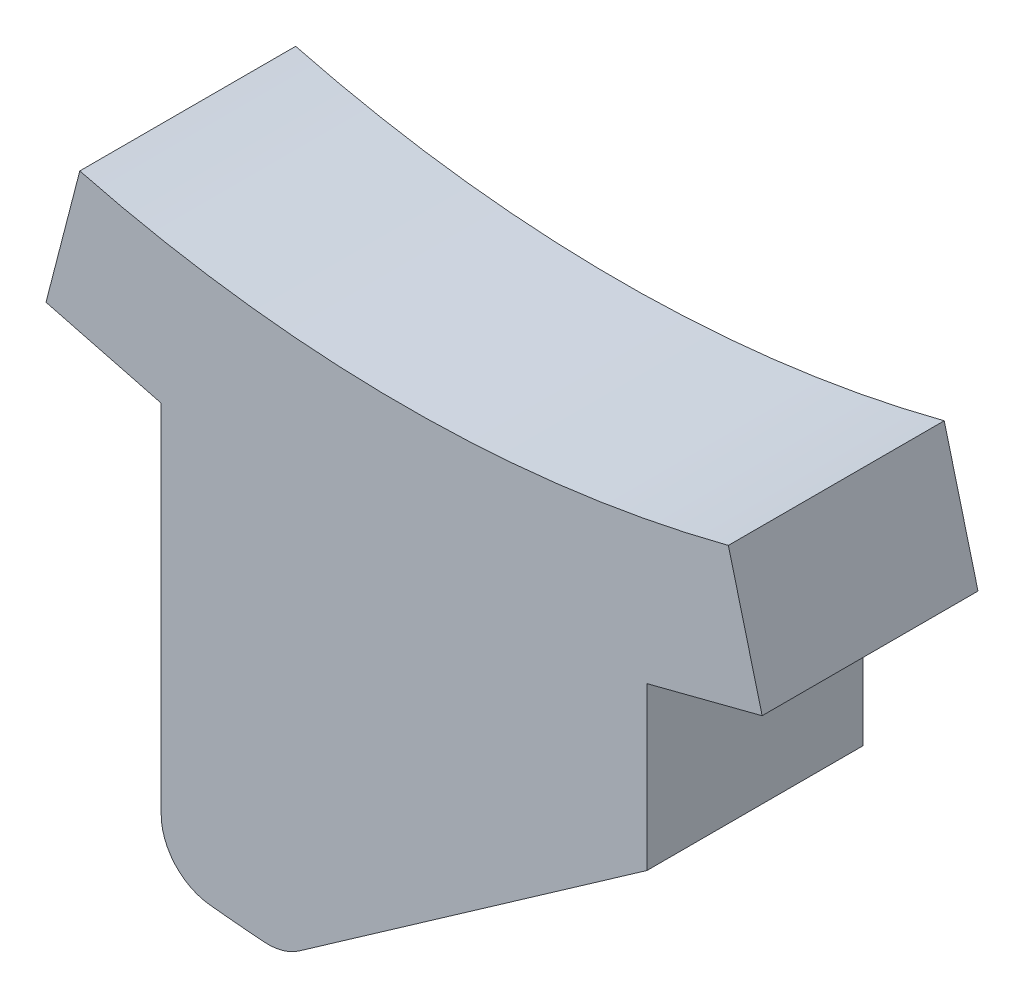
ISO-10303-21;
HEADER;
FILE_DESCRIPTION(('STEP AP214'),'2;1');
FILE_NAME('part.step','',(''),(''),'','','');
FILE_SCHEMA(('AUTOMOTIVE_DESIGN { 1 0 10303 214 1 1 1 1 }'));
ENDSEC;
DATA;
#1=APPLICATION_CONTEXT('core data for automotive mechanical design processes');
#2=APPLICATION_PROTOCOL_DEFINITION('international standard','automotive_design',2000,#1);
#3=PRODUCT_CONTEXT('',#1,'mechanical');
#4=PRODUCT('Part','Part','',(#3));
#5=PRODUCT_RELATED_PRODUCT_CATEGORY('part','',(#4));
#6=PRODUCT_DEFINITION_FORMATION('','',#4);
#7=PRODUCT_DEFINITION_CONTEXT('part definition',#1,'design');
#8=PRODUCT_DEFINITION('design','',#6,#7);
#9=PRODUCT_DEFINITION_SHAPE('','',#8);
#10=(LENGTH_UNIT() NAMED_UNIT(*) SI_UNIT(.MILLI.,.METRE.));
#11=(NAMED_UNIT(*) PLANE_ANGLE_UNIT() SI_UNIT($,.RADIAN.));
#12=(NAMED_UNIT(*) SI_UNIT($,.STERADIAN.) SOLID_ANGLE_UNIT());
#13=UNCERTAINTY_MEASURE_WITH_UNIT(LENGTH_MEASURE(1.E-05),#10,'distance_accuracy_value','');
#14=(GEOMETRIC_REPRESENTATION_CONTEXT(3) GLOBAL_UNCERTAINTY_ASSIGNED_CONTEXT((#13)) GLOBAL_UNIT_ASSIGNED_CONTEXT((#10,
#11,#12)) REPRESENTATION_CONTEXT('',''));
#15=CARTESIAN_POINT('',(0.,0.,0.));
#16=DIRECTION('',(0.,0.,1.));
#17=DIRECTION('',(1.,0.,0.));
#18=AXIS2_PLACEMENT_3D('',#15,#16,#17);
#19=CARTESIAN_POINT('',(0.,152.4,12.7));
#20=DIRECTION('',(0.,0.,-1.));
#21=DIRECTION('',(-1.,0.,0.));
#22=AXIS2_PLACEMENT_3D('',#19,#20,#21);
#23=CYLINDRICAL_SURFACE('',#22,152.4);
#24=CARTESIAN_POINT('',(0.,152.4,-12.7));
#25=DIRECTION('',(0.,0.,-1.));
#26=DIRECTION('',(1.,0.,0.));
#27=AXIS2_PLACEMENT_3D('',#24,#25,#26);
#28=CIRCLE('',#27,152.4);
#29=CARTESIAN_POINT('',(38.157912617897,4.85429960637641,-12.7));
#30=VERTEX_POINT('',#29);
#31=CARTESIAN_POINT('',(-38.157912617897,4.8542996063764,-12.7));
#32=VERTEX_POINT('',#31);
#33=EDGE_CURVE('E119',#30,#32,#28,.T.);
#34=ORIENTED_EDGE('',*,*,#33,.T.);
#35=DIRECTION('',(0.,0.,-1.));
#36=VECTOR('',#35,1.);
#37=CARTESIAN_POINT('',(-38.157912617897,4.8542996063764,12.7));
#38=LINE('',#37,#36);
#39=CARTESIAN_POINT('',(-38.157912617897,4.8542996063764,12.7));
#40=VERTEX_POINT('',#39);
#41=EDGE_CURVE('E127',#40,#32,#38,.T.);
#42=ORIENTED_EDGE('',*,*,#41,.F.);
#43=CARTESIAN_POINT('',(0.,152.4,12.7));
#44=DIRECTION('',(0.,0.,-1.));
#45=DIRECTION('',(1.,0.,0.));
#46=AXIS2_PLACEMENT_3D('',#43,#44,#45);
#47=CIRCLE('',#46,152.4);
#48=CARTESIAN_POINT('',(38.157912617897,4.85429960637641,12.7));
#49=VERTEX_POINT('',#48);
#50=EDGE_CURVE('E155',#49,#40,#47,.T.);
#51=ORIENTED_EDGE('',*,*,#50,.F.);
#52=DIRECTION('',(0.,0.,-1.));
#53=VECTOR('',#52,1.);
#54=CARTESIAN_POINT('',(38.157912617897,4.85429960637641,12.7));
#55=LINE('',#54,#53);
#56=EDGE_CURVE('E138',#49,#30,#55,.T.);
#57=ORIENTED_EDGE('',*,*,#56,.T.);
#58=EDGE_LOOP('',(#34,#42,#51,#57));
#59=FACE_BOUND('',#58,.T.);
#60=ADVANCED_FACE('F28',(#59),#23,.F.);
#61=CARTESIAN_POINT('',(-38.157912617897,4.8542996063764,12.7));
#62=DIRECTION('',(0.968147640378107,-0.250380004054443,0.));
#63=DIRECTION('',(0.250380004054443,0.968147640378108,0.));
#64=AXIS2_PLACEMENT_3D('',#61,#62,#63);
#65=PLANE('',#64);
#66=DIRECTION('',(-0.250380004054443,-0.968147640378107,0.));
#67=VECTOR('',#66,1.);
#68=CARTESIAN_POINT('',(-38.157912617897,4.8542996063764,-12.7));
#69=LINE('',#68,#67);
#70=CARTESIAN_POINT('',(-42.1326951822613,-10.5150441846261,-12.7));
#71=VERTEX_POINT('',#70);
#72=EDGE_CURVE('E113',#32,#71,#69,.T.);
#73=ORIENTED_EDGE('',*,*,#72,.T.);
#74=DIRECTION('',(0.,0.,-1.));
#75=VECTOR('',#74,1.);
#76=CARTESIAN_POINT('',(-42.1326951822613,-10.5150441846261,12.7));
#77=LINE('',#76,#75);
#78=CARTESIAN_POINT('',(-42.1326951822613,-10.5150441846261,12.7));
#79=VERTEX_POINT('',#78);
#80=EDGE_CURVE('E134',#79,#71,#77,.T.);
#81=ORIENTED_EDGE('',*,*,#80,.F.);
#82=DIRECTION('',(-0.250380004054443,-0.968147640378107,0.));
#83=VECTOR('',#82,1.);
#84=CARTESIAN_POINT('',(-38.157912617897,4.8542996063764,12.7));
#85=LINE('',#84,#83);
#86=EDGE_CURVE('E129',#40,#79,#85,.T.);
#87=ORIENTED_EDGE('',*,*,#86,.F.);
#88=ORIENTED_EDGE('',*,*,#41,.T.);
#89=EDGE_LOOP('',(#73,#81,#87,#88));
#90=FACE_BOUND('',#89,.T.);
#91=ADVANCED_FACE('F128',(#90),#65,.F.);
#92=CARTESIAN_POINT('',(-42.1326951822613,-10.5150441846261,12.7));
#93=DIRECTION('',(0.250380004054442,0.968147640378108,0.));
#94=DIRECTION('',(-0.968147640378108,0.250380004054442,0.));
#95=AXIS2_PLACEMENT_3D('',#92,#93,#94);
#96=PLANE('',#95);
#97=DIRECTION('',(0.968147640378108,-0.250380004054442,0.));
#98=VECTOR('',#97,1.);
#99=CARTESIAN_POINT('',(-42.1326951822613,-10.5150441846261,-12.7));
#100=LINE('',#99,#98);
#101=CARTESIAN_POINT('',(-28.575,-14.021302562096,-12.7));
#102=VERTEX_POINT('',#101);
#103=EDGE_CURVE('E121',#71,#102,#100,.T.);
#104=ORIENTED_EDGE('',*,*,#103,.T.);
#105=DIRECTION('',(0.,0.,-1.));
#106=VECTOR('',#105,1.);
#107=CARTESIAN_POINT('',(-28.575,-14.021302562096,12.7));
#108=LINE('',#107,#106);
#109=CARTESIAN_POINT('',(-28.575,-14.021302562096,12.7));
#110=VERTEX_POINT('',#109);
#111=EDGE_CURVE('E182',#110,#102,#108,.T.);
#112=ORIENTED_EDGE('',*,*,#111,.F.);
#113=DIRECTION('',(0.968147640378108,-0.250380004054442,0.));
#114=VECTOR('',#113,1.);
#115=CARTESIAN_POINT('',(-42.1326951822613,-10.5150441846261,12.7));
#116=LINE('',#115,#114);
#117=EDGE_CURVE('E158',#79,#110,#116,.T.);
#118=ORIENTED_EDGE('',*,*,#117,.F.);
#119=ORIENTED_EDGE('',*,*,#80,.T.);
#120=EDGE_LOOP('',(#104,#112,#118,#119));
#121=FACE_BOUND('',#120,.T.);
#122=ADVANCED_FACE('F208',(#121),#96,.F.);
#123=CARTESIAN_POINT('',(-28.575,-14.021302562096,12.7));
#124=DIRECTION('',(1.,0.,0.));
#125=DIRECTION('',(0.,1.,0.));
#126=AXIS2_PLACEMENT_3D('',#123,#124,#125);
#127=PLANE('',#126);
#128=DIRECTION('',(0.,-1.,0.));
#129=VECTOR('',#128,1.);
#130=CARTESIAN_POINT('',(-28.575,-14.021302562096,-12.7));
#131=LINE('',#130,#129);
#132=CARTESIAN_POINT('',(-28.575,-55.9680682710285,-12.7));
#133=VERTEX_POINT('',#132);
#134=EDGE_CURVE('E142',#102,#133,#131,.T.);
#135=ORIENTED_EDGE('',*,*,#134,.T.);
#136=DIRECTION('',(0.,0.,-1.));
#137=VECTOR('',#136,1.);
#138=CARTESIAN_POINT('',(-28.575,-55.9680682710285,12.7));
#139=LINE('',#138,#137);
#140=CARTESIAN_POINT('',(-28.575,-55.9680682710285,12.7));
#141=VERTEX_POINT('',#140);
#142=EDGE_CURVE('E50',#133,#141,#139,.F.);
#143=ORIENTED_EDGE('',*,*,#142,.T.);
#144=DIRECTION('',(0.,-1.,0.));
#145=VECTOR('',#144,1.);
#146=CARTESIAN_POINT('',(-28.575,-14.021302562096,12.7));
#147=LINE('',#146,#145);
#148=EDGE_CURVE('E160',#110,#141,#147,.T.);
#149=ORIENTED_EDGE('',*,*,#148,.F.);
#150=ORIENTED_EDGE('',*,*,#111,.T.);
#151=EDGE_LOOP('',(#135,#143,#149,#150));
#152=FACE_BOUND('',#151,.T.);
#153=ADVANCED_FACE('F204',(#152),#127,.F.);
#154=CARTESIAN_POINT('',(0.,152.4,12.7));
#155=DIRECTION('',(0.,0.,-1.));
#156=DIRECTION('',(-1.,0.,0.));
#157=AXIS2_PLACEMENT_3D('',#154,#155,#156);
#158=CYLINDRICAL_SURFACE('',#157,215.9);
#159=CARTESIAN_POINT('',(0.,152.4,12.7));
#160=DIRECTION('',(0.,0.,1.));
#161=DIRECTION('',(1.,0.,0.));
#162=AXIS2_PLACEMENT_3D('',#159,#160,#161);
#163=CIRCLE('',#162,215.9);
#164=CARTESIAN_POINT('',(-22.8984848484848,-62.2822521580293,12.7));
#165=VERTEX_POINT('',#164);
#166=CARTESIAN_POINT('',(-16.4943177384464,-62.8690118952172,12.7));
#167=VERTEX_POINT('',#166);
#168=EDGE_CURVE('E162',#165,#167,#163,.T.);
#169=ORIENTED_EDGE('',*,*,#168,.F.);
#170=DIRECTION('',(0.,0.,-1.));
#171=VECTOR('',#170,1.);
#172=CARTESIAN_POINT('',(-22.8984848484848,-62.2822521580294,12.7));
#173=LINE('',#172,#171);
#174=CARTESIAN_POINT('',(-22.8984848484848,-62.2822521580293,-12.7));
#175=VERTEX_POINT('',#174);
#176=EDGE_CURVE('E187',#165,#175,#173,.T.);
#177=ORIENTED_EDGE('',*,*,#176,.T.);
#178=CARTESIAN_POINT('',(0.,152.4,-12.7));
#179=DIRECTION('',(0.,0.,1.));
#180=DIRECTION('',(1.,0.,0.));
#181=AXIS2_PLACEMENT_3D('',#178,#179,#180);
#182=CIRCLE('',#181,215.9);
#183=CARTESIAN_POINT('',(-16.4943177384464,-62.8690118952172,-12.7));
#184=VERTEX_POINT('',#183);
#185=EDGE_CURVE('E144',#175,#184,#182,.T.);
#186=ORIENTED_EDGE('',*,*,#185,.T.);
#187=DIRECTION('',(0.,0.,-1.));
#188=VECTOR('',#187,1.);
#189=CARTESIAN_POINT('',(-16.4943177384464,-62.8690118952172,12.7));
#190=LINE('',#189,#188);
#191=EDGE_CURVE('E133',#184,#167,#190,.F.);
#192=ORIENTED_EDGE('',*,*,#191,.T.);
#193=EDGE_LOOP('',(#169,#177,#186,#192));
#194=FACE_BOUND('',#193,.T.);
#195=ADVANCED_FACE('F201',(#194),#158,.T.);
#196=CARTESIAN_POINT('',(-14.2128413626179,-63.0316716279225,12.7));
#197=DIRECTION('',(-0.57357643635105,0.819152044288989,0.));
#198=DIRECTION('',(-0.819152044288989,-0.57357643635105,0.));
#199=AXIS2_PLACEMENT_3D('',#196,#197,#198);
#200=PLANE('',#199);
#201=DIRECTION('',(0.819152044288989,0.57357643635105,0.));
#202=VECTOR('',#201,1.);
#203=CARTESIAN_POINT('',(-14.2128413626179,-63.0316716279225,12.7));
#204=LINE('',#203,#202);
#205=CARTESIAN_POINT('',(-12.36698037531,-61.7391858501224,12.7));
#206=VERTEX_POINT('',#205);
#207=CARTESIAN_POINT('',(28.575,-33.071302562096,12.7));
#208=VERTEX_POINT('',#207);
#209=EDGE_CURVE('E164',#206,#208,#204,.T.);
#210=ORIENTED_EDGE('',*,*,#209,.F.);
#211=DIRECTION('',(0.,0.,-1.));
#212=VECTOR('',#211,1.);
#213=CARTESIAN_POINT('',(-12.36698037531,-61.7391858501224,12.7));
#214=LINE('',#213,#212);
#215=CARTESIAN_POINT('',(-12.36698037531,-61.7391858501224,-12.7));
#216=VERTEX_POINT('',#215);
#217=EDGE_CURVE('E11',#206,#216,#214,.T.);
#218=ORIENTED_EDGE('',*,*,#217,.T.);
#219=DIRECTION('',(0.819152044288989,0.57357643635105,0.));
#220=VECTOR('',#219,1.);
#221=CARTESIAN_POINT('',(-14.2128413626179,-63.0316716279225,-12.7));
#222=LINE('',#221,#220);
#223=CARTESIAN_POINT('',(28.575,-33.071302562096,-12.7));
#224=VERTEX_POINT('',#223);
#225=EDGE_CURVE('E147',#216,#224,#222,.T.);
#226=ORIENTED_EDGE('',*,*,#225,.T.);
#227=DIRECTION('',(0.,0.,-1.));
#228=VECTOR('',#227,1.);
#229=CARTESIAN_POINT('',(28.575,-33.071302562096,12.7));
#230=LINE('',#229,#228);
#231=EDGE_CURVE('E179',#208,#224,#230,.T.);
#232=ORIENTED_EDGE('',*,*,#231,.F.);
#233=EDGE_LOOP('',(#210,#218,#226,#232));
#234=FACE_BOUND('',#233,.T.);
#235=ADVANCED_FACE('F225',(#234),#200,.F.);
#236=CARTESIAN_POINT('',(28.575,-33.071302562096,12.7));
#237=DIRECTION('',(-1.,0.,0.));
#238=DIRECTION('',(0.,-1.,0.));
#239=AXIS2_PLACEMENT_3D('',#236,#237,#238);
#240=PLANE('',#239);
#241=DIRECTION('',(0.,1.,0.));
#242=VECTOR('',#241,1.);
#243=CARTESIAN_POINT('',(28.575,-33.071302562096,-12.7));
#244=LINE('',#243,#242);
#245=CARTESIAN_POINT('',(28.575,-14.021302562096,-12.7));
#246=VERTEX_POINT('',#245);
#247=EDGE_CURVE('E149',#224,#246,#244,.T.);
#248=ORIENTED_EDGE('',*,*,#247,.T.);
#249=DIRECTION('',(0.,0.,-1.));
#250=VECTOR('',#249,1.);
#251=CARTESIAN_POINT('',(28.575,-14.021302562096,12.7));
#252=LINE('',#251,#250);
#253=CARTESIAN_POINT('',(28.575,-14.021302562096,12.7));
#254=VERTEX_POINT('',#253);
#255=EDGE_CURVE('E176',#254,#246,#252,.T.);
#256=ORIENTED_EDGE('',*,*,#255,.F.);
#257=DIRECTION('',(0.,1.,0.));
#258=VECTOR('',#257,1.);
#259=CARTESIAN_POINT('',(28.575,-33.071302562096,12.7));
#260=LINE('',#259,#258);
#261=EDGE_CURVE('E166',#208,#254,#260,.T.);
#262=ORIENTED_EDGE('',*,*,#261,.F.);
#263=ORIENTED_EDGE('',*,*,#231,.T.);
#264=EDGE_LOOP('',(#248,#256,#262,#263));
#265=FACE_BOUND('',#264,.T.);
#266=ADVANCED_FACE('F222',(#265),#240,.F.);
#267=CARTESIAN_POINT('',(28.575,-14.021302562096,12.7));
#268=DIRECTION('',(-0.250380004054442,0.968147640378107,0.));
#269=DIRECTION('',(-0.968147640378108,-0.250380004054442,0.));
#270=AXIS2_PLACEMENT_3D('',#267,#268,#269);
#271=PLANE('',#270);
#272=DIRECTION('',(0.968147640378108,0.250380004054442,0.));
#273=VECTOR('',#272,1.);
#274=CARTESIAN_POINT('',(28.575,-14.021302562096,-12.7));
#275=LINE('',#274,#273);
#276=CARTESIAN_POINT('',(42.1326951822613,-10.515044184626,-12.7));
#277=VERTEX_POINT('',#276);
#278=EDGE_CURVE('E151',#246,#277,#275,.T.);
#279=ORIENTED_EDGE('',*,*,#278,.T.);
#280=DIRECTION('',(0.,0.,-1.));
#281=VECTOR('',#280,1.);
#282=CARTESIAN_POINT('',(42.1326951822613,-10.515044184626,12.7));
#283=LINE('',#282,#281);
#284=CARTESIAN_POINT('',(42.1326951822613,-10.515044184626,12.7));
#285=VERTEX_POINT('',#284);
#286=EDGE_CURVE('E173',#285,#277,#283,.T.);
#287=ORIENTED_EDGE('',*,*,#286,.F.);
#288=DIRECTION('',(0.968147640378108,0.250380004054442,0.));
#289=VECTOR('',#288,1.);
#290=CARTESIAN_POINT('',(28.575,-14.021302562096,12.7));
#291=LINE('',#290,#289);
#292=EDGE_CURVE('E168',#254,#285,#291,.T.);
#293=ORIENTED_EDGE('',*,*,#292,.F.);
#294=ORIENTED_EDGE('',*,*,#255,.T.);
#295=EDGE_LOOP('',(#279,#287,#293,#294));
#296=FACE_BOUND('',#295,.T.);
#297=ADVANCED_FACE('F218',(#296),#271,.F.);
#298=CARTESIAN_POINT('',(38.157912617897,4.85429960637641,12.7));
#299=DIRECTION('',(-0.968147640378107,-0.250380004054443,0.));
#300=DIRECTION('',(0.250380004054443,-0.968147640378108,0.));
#301=AXIS2_PLACEMENT_3D('',#298,#299,#300);
#302=PLANE('',#301);
#303=DIRECTION('',(-0.250380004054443,0.968147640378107,0.));
#304=VECTOR('',#303,1.);
#305=CARTESIAN_POINT('',(38.157912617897,4.85429960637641,-12.7));
#306=LINE('',#305,#304);
#307=EDGE_CURVE('E153',#277,#30,#306,.T.);
#308=ORIENTED_EDGE('',*,*,#307,.T.);
#309=ORIENTED_EDGE('',*,*,#56,.F.);
#310=DIRECTION('',(-0.250380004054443,0.968147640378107,0.));
#311=VECTOR('',#310,1.);
#312=CARTESIAN_POINT('',(38.157912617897,4.85429960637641,12.7));
#313=LINE('',#312,#311);
#314=EDGE_CURVE('E170',#285,#49,#313,.T.);
#315=ORIENTED_EDGE('',*,*,#314,.F.);
#316=ORIENTED_EDGE('',*,*,#286,.T.);
#317=EDGE_LOOP('',(#308,#309,#315,#316));
#318=FACE_BOUND('',#317,.T.);
#319=ADVANCED_FACE('F213',(#318),#302,.F.);
#320=CARTESIAN_POINT('',(0.,152.4,12.7));
#321=DIRECTION('',(0.,0.,1.));
#322=DIRECTION('',(1.,0.,0.));
#323=AXIS2_PLACEMENT_3D('',#320,#321,#322);
#324=PLANE('',#323);
#325=ORIENTED_EDGE('',*,*,#148,.T.);
#326=CARTESIAN_POINT('',(-22.225,-55.9680682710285,12.7));
#327=DIRECTION('',(0.,0.,1.));
#328=DIRECTION('',(1.,0.,0.));
#329=AXIS2_PLACEMENT_3D('',#326,#327,#328);
#330=CIRCLE('',#329,6.35);
#331=EDGE_CURVE('E35',#141,#165,#330,.T.);
#332=ORIENTED_EDGE('',*,*,#331,.T.);
#333=ORIENTED_EDGE('',*,*,#168,.T.);
#334=CARTESIAN_POINT('',(-16.0091907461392,-56.5375703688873,12.7));
#335=DIRECTION('',(0.,0.,1.));
#336=DIRECTION('',(1.,0.,0.));
#337=AXIS2_PLACEMENT_3D('',#334,#335,#336);
#338=CIRCLE('',#337,6.35);
#339=EDGE_CURVE('E42',#167,#206,#338,.T.);
#340=ORIENTED_EDGE('',*,*,#339,.T.);
#341=ORIENTED_EDGE('',*,*,#209,.T.);
#342=ORIENTED_EDGE('',*,*,#261,.T.);
#343=ORIENTED_EDGE('',*,*,#292,.T.);
#344=ORIENTED_EDGE('',*,*,#314,.T.);
#345=ORIENTED_EDGE('',*,*,#50,.T.);
#346=ORIENTED_EDGE('',*,*,#86,.T.);
#347=ORIENTED_EDGE('',*,*,#117,.T.);
#348=EDGE_LOOP('',(#325,#332,#333,#340,#341,#342,#343,#344,#345,#346,#347));
#349=FACE_BOUND('',#348,.T.);
#350=ADVANCED_FACE('F197',(#349),#324,.T.);
#351=CARTESIAN_POINT('',(0.,152.4,-12.7));
#352=DIRECTION('',(0.,0.,1.));
#353=DIRECTION('',(1.,0.,0.));
#354=AXIS2_PLACEMENT_3D('',#351,#352,#353);
#355=PLANE('',#354);
#356=ORIENTED_EDGE('',*,*,#185,.F.);
#357=CARTESIAN_POINT('',(-22.225,-55.9680682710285,-12.7));
#358=DIRECTION('',(0.,0.,1.));
#359=DIRECTION('',(1.,0.,0.));
#360=AXIS2_PLACEMENT_3D('',#357,#358,#359);
#361=CIRCLE('',#360,6.35);
#362=EDGE_CURVE('E192',#175,#133,#361,.F.);
#363=ORIENTED_EDGE('',*,*,#362,.T.);
#364=ORIENTED_EDGE('',*,*,#134,.F.);
#365=ORIENTED_EDGE('',*,*,#103,.F.);
#366=ORIENTED_EDGE('',*,*,#72,.F.);
#367=ORIENTED_EDGE('',*,*,#33,.F.);
#368=ORIENTED_EDGE('',*,*,#307,.F.);
#369=ORIENTED_EDGE('',*,*,#278,.F.);
#370=ORIENTED_EDGE('',*,*,#247,.F.);
#371=ORIENTED_EDGE('',*,*,#225,.F.);
#372=CARTESIAN_POINT('',(-16.0091907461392,-56.5375703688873,-12.7));
#373=DIRECTION('',(0.,0.,1.));
#374=DIRECTION('',(1.,0.,0.));
#375=AXIS2_PLACEMENT_3D('',#372,#373,#374);
#376=CIRCLE('',#375,6.35);
#377=EDGE_CURVE('E190',#216,#184,#376,.F.);
#378=ORIENTED_EDGE('',*,*,#377,.T.);
#379=EDGE_LOOP('',(#356,#363,#364,#365,#366,#367,#368,#369,#370,#371,#378));
#380=FACE_BOUND('',#379,.T.);
#381=ADVANCED_FACE('F116',(#380),#355,.F.);
#382=CARTESIAN_POINT('',(-22.225,-55.9680682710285,12.7));
#383=DIRECTION('',(0.,0.,-1.));
#384=DIRECTION('',(-1.,0.,0.));
#385=AXIS2_PLACEMENT_3D('',#382,#383,#384);
#386=CYLINDRICAL_SURFACE('',#385,6.35);
#387=ORIENTED_EDGE('',*,*,#331,.F.);
#388=ORIENTED_EDGE('',*,*,#142,.F.);
#389=ORIENTED_EDGE('',*,*,#362,.F.);
#390=ORIENTED_EDGE('',*,*,#176,.F.);
#391=EDGE_LOOP('',(#387,#388,#389,#390));
#392=FACE_BOUND('',#391,.T.);
#393=ADVANCED_FACE('F203',(#392),#386,.T.);
#394=CARTESIAN_POINT('',(-16.0091907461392,-56.5375703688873,12.7));
#395=DIRECTION('',(0.,0.,-1.));
#396=DIRECTION('',(-1.,0.,0.));
#397=AXIS2_PLACEMENT_3D('',#394,#395,#396);
#398=CYLINDRICAL_SURFACE('',#397,6.35);
#399=ORIENTED_EDGE('',*,*,#339,.F.);
#400=ORIENTED_EDGE('',*,*,#191,.F.);
#401=ORIENTED_EDGE('',*,*,#377,.F.);
#402=ORIENTED_EDGE('',*,*,#217,.F.);
#403=EDGE_LOOP('',(#399,#400,#401,#402));
#404=FACE_BOUND('',#403,.T.);
#405=ADVANCED_FACE('F228',(#404),#398,.T.);
#406=CLOSED_SHELL('',(#60,#91,#122,#153,#195,#235,#266,#297,#319,#350,#381,#393,#405));
#407=MANIFOLD_SOLID_BREP('B2',#406);
#408=ADVANCED_BREP_SHAPE_REPRESENTATION('',(#18,#407),#14);
#409=SHAPE_DEFINITION_REPRESENTATION(#9,#408);
ENDSEC;
END-ISO-10303-21;
